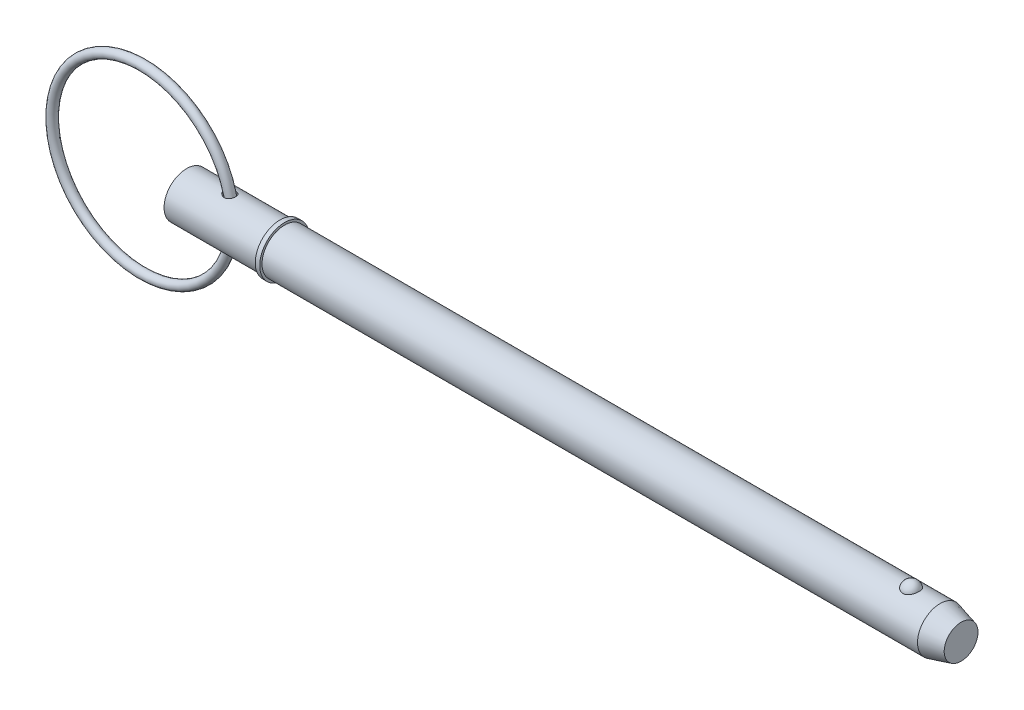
ISO-10303-21;
HEADER;
FILE_DESCRIPTION(('STEP AP214'),'2;1');
FILE_NAME('part.step','',(''),(''),'','','');
FILE_SCHEMA(('AUTOMOTIVE_DESIGN { 1 0 10303 214 1 1 1 1 }'));
ENDSEC;
DATA;
#1=APPLICATION_CONTEXT('core data for automotive mechanical design processes');
#2=APPLICATION_PROTOCOL_DEFINITION('international standard','automotive_design',2000,#1);
#3=PRODUCT_CONTEXT('',#1,'mechanical');
#4=PRODUCT('Part','Part','',(#3));
#5=PRODUCT_RELATED_PRODUCT_CATEGORY('part','',(#4));
#6=PRODUCT_DEFINITION_FORMATION('','',#4);
#7=PRODUCT_DEFINITION_CONTEXT('part definition',#1,'design');
#8=PRODUCT_DEFINITION('design','',#6,#7);
#9=PRODUCT_DEFINITION_SHAPE('','',#8);
#10=(LENGTH_UNIT() NAMED_UNIT(*) SI_UNIT(.MILLI.,.METRE.));
#11=(NAMED_UNIT(*) PLANE_ANGLE_UNIT() SI_UNIT($,.RADIAN.));
#12=(NAMED_UNIT(*) SI_UNIT($,.STERADIAN.) SOLID_ANGLE_UNIT());
#13=UNCERTAINTY_MEASURE_WITH_UNIT(LENGTH_MEASURE(1.E-05),#10,'distance_accuracy_value','');
#14=(GEOMETRIC_REPRESENTATION_CONTEXT(3) GLOBAL_UNCERTAINTY_ASSIGNED_CONTEXT((#13)) GLOBAL_UNIT_ASSIGNED_CONTEXT((#10,
#11,#12)) REPRESENTATION_CONTEXT('',''));
#15=CARTESIAN_POINT('',(0.,0.,0.));
#16=DIRECTION('',(0.,0.,1.));
#17=DIRECTION('',(1.,0.,0.));
#18=AXIS2_PLACEMENT_3D('',#15,#16,#17);
#19=CARTESIAN_POINT('',(-10.8860601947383,0.,0.));
#20=DIRECTION('',(0.,0.,1.));
#21=DIRECTION('',(1.,0.,0.));
#22=AXIS2_PLACEMENT_3D('',#19,#20,#21);
#23=TOROIDAL_SURFACE('',#22,22.225,1.111);
#24=CARTESIAN_POINT('',(12.4499398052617,0.,0.));
#25=VERTEX_POINT('',#24);
#26=VERTEX_LOOP('',#25);
#27=FACE_BOUND('',#26,.T.);
#28=ADVANCED_FACE('P0_F12',(#27),#23,.T.);
#29=CLOSED_SHELL('',(#28));
#30=MANIFOLD_SOLID_BREP('P0_B1',#29);
#31=CARTESIAN_POINT('',(0.,0.,0.));
#32=DIRECTION('',(1.,0.,0.));
#33=DIRECTION('',(0.,0.,-1.));
#34=AXIS2_PLACEMENT_3D('',#31,#32,#33);
#35=CYLINDRICAL_SURFACE('',#34,5.555);
#36=CARTESIAN_POINT('',(9.73108588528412,5.4531967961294,-1.05861687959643));
#37=CARTESIAN_POINT('',(9.79852417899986,5.4428857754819,-1.11173367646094));
#38=CARTESIAN_POINT('',(9.8705426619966,5.43287373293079,-1.15917228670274));
#39=CARTESIAN_POINT('',(10.0216706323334,5.41463354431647,-1.24159548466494));
#40=CARTESIAN_POINT('',(10.100788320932,5.40640749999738,-1.27656543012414));
#41=CARTESIAN_POINT('',(10.2640671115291,5.39277501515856,-1.33298568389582));
#42=CARTESIAN_POINT('',(10.3482338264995,5.38737178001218,-1.35442062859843));
#43=CARTESIAN_POINT('',(10.5191189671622,5.38018930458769,-1.38268153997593));
#44=CARTESIAN_POINT('',(10.6058357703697,5.37840780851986,-1.38951660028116));
#45=CARTESIAN_POINT('',(10.7759121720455,5.37883071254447,-1.38787777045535));
#46=CARTESIAN_POINT('',(10.8592768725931,5.38088957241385,-1.37996287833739));
#47=CARTESIAN_POINT('',(11.0231742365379,5.38856355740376,-1.34968531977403));
#48=CARTESIAN_POINT('',(11.1037078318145,5.39417750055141,-1.3273274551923));
#49=CARTESIAN_POINT('',(11.2542656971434,5.40784427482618,-1.27044672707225));
#50=CARTESIAN_POINT('',(11.3246325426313,5.41571997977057,-1.23678468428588));
#51=CARTESIAN_POINT('',(11.4584043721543,5.43310849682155,-1.15800564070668));
#52=CARTESIAN_POINT('',(11.5218100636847,5.44262114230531,-1.11288980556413));
#53=CARTESIAN_POINT('',(11.6387006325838,5.4619946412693,-1.01348173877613));
#54=CARTESIAN_POINT('',(11.6923567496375,5.47184490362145,-0.959388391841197));
#55=CARTESIAN_POINT('',(11.7899079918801,5.49098914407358,-0.842935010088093));
#56=CARTESIAN_POINT('',(11.8338027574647,5.5002831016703,-0.780574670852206));
#57=CARTESIAN_POINT('',(11.9111930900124,5.51740919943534,-0.648605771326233));
#58=CARTESIAN_POINT('',(11.944571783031,5.52522454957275,-0.578926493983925));
#59=CARTESIAN_POINT('',(11.9994972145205,5.5384271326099,-0.434834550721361));
#60=CARTESIAN_POINT('',(12.0210434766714,5.54381426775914,-0.360421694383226));
#61=CARTESIAN_POINT('',(12.0519313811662,5.55161917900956,-0.208311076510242));
#62=CARTESIAN_POINT('',(12.0611710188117,5.55401212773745,-0.130591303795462));
#63=CARTESIAN_POINT('',(12.0668974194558,5.55548938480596,0.025348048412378));
#64=CARTESIAN_POINT('',(12.0633840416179,5.55457365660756,0.103567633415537));
#65=CARTESIAN_POINT('',(12.0436796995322,5.54953010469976,0.258343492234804));
#66=CARTESIAN_POINT('',(12.0274798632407,5.54540003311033,0.334898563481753));
#67=CARTESIAN_POINT('',(11.9827711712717,5.53437033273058,0.484118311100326));
#68=CARTESIAN_POINT('',(11.9542620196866,5.52747063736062,0.556782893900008));
#69=CARTESIAN_POINT('',(11.8856108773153,5.51165296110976,0.696153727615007));
#70=CARTESIAN_POINT('',(11.8454690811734,5.50273501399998,0.762860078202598));
#71=CARTESIAN_POINT('',(11.7545317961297,5.48386724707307,0.888403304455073));
#72=CARTESIAN_POINT('',(11.7037367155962,5.47391746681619,0.94724048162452));
#73=CARTESIAN_POINT('',(11.5931044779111,5.45416351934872,1.05504470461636));
#74=CARTESIAN_POINT('',(11.533318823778,5.44435885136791,1.10406448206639));
#75=CARTESIAN_POINT('',(11.4061321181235,5.42595363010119,1.19123649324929));
#76=CARTESIAN_POINT('',(11.3387321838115,5.41735290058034,1.22939031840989));
#77=CARTESIAN_POINT('',(11.1991395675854,5.4024225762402,1.29341737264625));
#78=CARTESIAN_POINT('',(11.1270175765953,5.3960658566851,1.3194385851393));
#79=CARTESIAN_POINT('',(10.979323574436,5.38614405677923,1.35937634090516));
#80=CARTESIAN_POINT('',(10.9037515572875,5.38257898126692,1.37329286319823));
#81=CARTESIAN_POINT('',(10.7507722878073,5.37854282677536,1.38901730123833));
#82=CARTESIAN_POINT('',(10.6733560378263,5.37809300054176,1.39074204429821));
#83=CARTESIAN_POINT('',(10.5192388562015,5.38029043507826,1.38221411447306));
#84=CARTESIAN_POINT('',(10.4425381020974,5.38293844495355,1.37195854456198));
#85=CARTESIAN_POINT('',(10.2878936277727,5.39116673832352,1.33926960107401));
#86=CARTESIAN_POINT('',(10.2100819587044,5.3968880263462,1.31624874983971));
#87=CARTESIAN_POINT('',(10.0591420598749,5.4106466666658,1.25849276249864));
#88=CARTESIAN_POINT('',(9.98601576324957,5.41868496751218,1.22375282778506));
#89=CARTESIAN_POINT('',(9.84175565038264,5.43675805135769,1.14087469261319));
#90=CARTESIAN_POINT('',(9.77103801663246,5.44688674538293,1.09202994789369));
#91=CARTESIAN_POINT('',(9.63888287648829,5.46759592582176,0.983100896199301));
#92=CARTESIAN_POINT('',(9.57744762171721,5.47817652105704,0.923013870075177));
#93=CARTESIAN_POINT('',(9.4662044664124,5.49850106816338,0.792984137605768));
#94=CARTESIAN_POINT('',(9.4163677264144,5.5082470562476,0.723066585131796));
#95=CARTESIAN_POINT('',(9.33050546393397,5.52566389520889,0.574973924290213));
#96=CARTESIAN_POINT('',(9.29446727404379,5.53333664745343,0.496806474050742));
#97=CARTESIAN_POINT('',(9.24109888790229,5.54491199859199,0.342579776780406));
#98=CARTESIAN_POINT('',(9.22228936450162,5.54910883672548,0.26705568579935));
#99=CARTESIAN_POINT('',(9.19883437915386,5.55436306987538,0.113748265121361));
#100=CARTESIAN_POINT('',(9.19417820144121,5.55542284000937,0.0359666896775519));
#101=CARTESIAN_POINT('',(9.19905385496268,5.55432298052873,-0.111477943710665));
#102=CARTESIAN_POINT('',(9.20724428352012,5.55246769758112,-0.181191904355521));
#103=CARTESIAN_POINT('',(9.23493000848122,5.54630180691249,-0.318223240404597));
#104=CARTESIAN_POINT('',(9.25442702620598,5.54199082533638,-0.385540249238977));
#105=CARTESIAN_POINT('',(9.30387481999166,5.5313474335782,-0.516280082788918));
#106=CARTESIAN_POINT('',(9.33386163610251,5.52500806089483,-0.579688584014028));
#107=CARTESIAN_POINT('',(9.40305503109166,5.51092599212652,-0.701037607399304));
#108=CARTESIAN_POINT('',(9.44225922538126,5.50318365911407,-0.758979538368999));
#109=CARTESIAN_POINT('',(9.52133732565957,5.48833949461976,-0.859230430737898));
#110=CARTESIAN_POINT('',(9.55998996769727,5.48134889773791,-0.902529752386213));
#111=CARTESIAN_POINT('',(9.64209346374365,5.46725903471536,-0.984288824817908));
#112=CARTESIAN_POINT('',(9.68554534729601,5.46015974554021,-1.02274753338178));
#113=CARTESIAN_POINT('',(9.73108588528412,5.4531967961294,-1.05861687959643));
#114=B_SPLINE_CURVE_WITH_KNOTS('',3,(#36,#37,#38,#39,#40,#41,#42,#43,#44,#45,#46,#47,#48,#49,
#50,#51,#52,#53,#54,#55,#56,#57,#58,#59,#60,#61,#62,#63,#64,#65,#66,#67,#68,#69,#70,#71,#72,#73,
#74,#75,#76,#77,#78,#79,#80,#81,#82,#83,#84,#85,#86,#87,#88,#89,#90,#91,#92,#93,#94,#95,#96,#97,
#98,#99,#100,#101,#102,#103,#104,#105,#106,#107,#108,#109,#110,#111,#112,#113),.UNSPECIFIED.,
.T.,.F.,(4,2,2,2,2,2,2,2,2,2,2,2,2,2,2,2,2,2,2,2,2,2,2,2,2,2,2,2,2,2,2,2,2,2,2,2,2,2,4),(0.,
0.259176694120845,0.518656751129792,0.778430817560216,1.03804303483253,1.28801585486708,
1.53790560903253,1.77195750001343,2.00598558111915,2.23539047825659,2.4648038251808,
2.69668356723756,2.9285726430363,3.16237203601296,3.39617401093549,3.63013963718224,
3.86411088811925,4.09807822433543,4.33203659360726,4.56470246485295,4.79733424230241,
5.02704913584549,5.25676442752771,5.48804534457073,5.71938220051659,5.96237360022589,
6.20546461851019,6.46387943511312,6.72235683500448,6.98018450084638,7.23777490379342,
7.4702968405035,7.70264268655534,7.91229396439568,8.12197716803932,8.33238797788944,
8.54274441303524,8.71772674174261,8.89274668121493),.UNSPECIFIED.);
#115=CARTESIAN_POINT('',(9.73108588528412,5.4531967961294,-1.05861687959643));
#116=VERTEX_POINT('',#115);
#117=EDGE_CURVE('P1_E42',#116,#116,#114,.T.);
#118=ORIENTED_EDGE('',*,*,#117,.T.);
#119=EDGE_LOOP('',(#118));
#120=FACE_BOUND('',#119,.T.);
#121=CARTESIAN_POINT('',(0.,0.,0.));
#122=DIRECTION('',(1.,0.,0.));
#123=DIRECTION('',(0.,0.,-1.));
#124=AXIS2_PLACEMENT_3D('',#121,#122,#123);
#125=CIRCLE('',#124,5.555);
#126=CARTESIAN_POINT('',(0.,0.,-5.555));
#127=VERTEX_POINT('',#126);
#128=EDGE_CURVE('P1_E9',#127,#127,#125,.T.);
#129=ORIENTED_EDGE('',*,*,#128,.T.);
#130=EDGE_LOOP('',(#129));
#131=FACE_BOUND('',#130,.T.);
#132=CARTESIAN_POINT('',(23.019,0.,0.));
#133=DIRECTION('',(1.,0.,0.));
#134=DIRECTION('',(0.,0.,-1.));
#135=AXIS2_PLACEMENT_3D('',#132,#133,#134);
#136=CIRCLE('',#135,5.555);
#137=CARTESIAN_POINT('',(23.019,0.,-5.555));
#138=VERTEX_POINT('',#137);
#139=EDGE_CURVE('P1_E25',#138,#138,#136,.T.);
#140=ORIENTED_EDGE('',*,*,#139,.F.);
#141=EDGE_LOOP('',(#140));
#142=FACE_BOUND('',#141,.T.);
#143=CARTESIAN_POINT('',(9.73108588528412,-5.4531967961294,-1.05861687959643));
#144=CARTESIAN_POINT('',(9.66821110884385,-5.46281068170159,-1.00909184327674));
#145=CARTESIAN_POINT('',(9.60927221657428,-5.47269103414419,-0.954597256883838));
#146=CARTESIAN_POINT('',(9.50103698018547,-5.49196271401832,-0.836622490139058));
#147=CARTESIAN_POINT('',(9.45174193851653,-5.50135397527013,-0.773141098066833));
#148=CARTESIAN_POINT('',(9.36449982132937,-5.51864538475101,-0.638139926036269));
#149=CARTESIAN_POINT('',(9.32660692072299,-5.52653835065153,-0.566583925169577));
#150=CARTESIAN_POINT('',(9.26443740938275,-5.53978685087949,-0.417563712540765));
#151=CARTESIAN_POINT('',(9.24015003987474,-5.54514438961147,-0.34010422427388));
#152=CARTESIAN_POINT('',(9.20806696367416,-5.55228040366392,-0.188389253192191));
#153=CARTESIAN_POINT('',(9.19907227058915,-5.55431849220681,-0.114399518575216));
#154=CARTESIAN_POINT('',(9.19432225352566,-5.55539069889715,0.0340148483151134));
#155=CARTESIAN_POINT('',(9.19856204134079,-5.55442592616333,0.108439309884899));
#156=CARTESIAN_POINT('',(9.21926816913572,-5.54978420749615,0.250226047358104));
#157=CARTESIAN_POINT('',(9.2348766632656,-5.54629766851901,0.31772275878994));
#158=CARTESIAN_POINT('',(9.27656619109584,-5.53719805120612,0.449233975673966));
#159=CARTESIAN_POINT('',(9.3026486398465,-5.53158468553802,0.513248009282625));
#160=CARTESIAN_POINT('',(9.36540111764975,-5.51852259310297,0.63880901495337));
#161=CARTESIAN_POINT('',(9.40244578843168,-5.51101059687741,0.700161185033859));
#162=CARTESIAN_POINT('',(9.48531033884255,-5.49498546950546,0.816463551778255));
#163=CARTESIAN_POINT('',(9.5311337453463,-5.48647193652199,0.871411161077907));
#164=CARTESIAN_POINT('',(9.63549825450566,-5.46826315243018,0.979510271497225));
#165=CARTESIAN_POINT('',(9.69487291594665,-5.4585383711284,1.03185240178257));
#166=CARTESIAN_POINT('',(9.82107706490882,-5.43973797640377,1.12677509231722));
#167=CARTESIAN_POINT('',(9.8879103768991,-5.43066269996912,1.16935061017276));
#168=CARTESIAN_POINT('',(10.033391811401,-5.41336505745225,1.24708757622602));
#169=CARTESIAN_POINT('',(10.1125613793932,-5.40528106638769,1.28130933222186));
#170=CARTESIAN_POINT('',(10.2757060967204,-5.39196874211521,1.3362270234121));
#171=CARTESIAN_POINT('',(10.3596813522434,-5.38674047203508,1.35692265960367));
#172=CARTESIAN_POINT('',(10.5297702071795,-5.37991196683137,1.38375156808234));
#173=CARTESIAN_POINT('',(10.6158742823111,-5.37829778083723,1.38994084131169));
#174=CARTESIAN_POINT('',(10.7878226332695,-5.37901070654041,1.38718250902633));
#175=CARTESIAN_POINT('',(10.8736670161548,-5.38133587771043,1.37824235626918));
#176=CARTESIAN_POINT('',(11.0366214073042,-5.38945418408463,1.34612618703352));
#177=CARTESIAN_POINT('',(11.1139351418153,-5.39501006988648,1.32392147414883));
#178=CARTESIAN_POINT('',(11.2633246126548,-5.40877222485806,1.26652021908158));
#179=CARTESIAN_POINT('',(11.3354015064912,-5.41697790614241,1.23132655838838));
#180=CARTESIAN_POINT('',(11.4690899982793,-5.43466078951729,1.15069817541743));
#181=CARTESIAN_POINT('',(11.5310200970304,-5.4440673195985,1.10577441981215));
#182=CARTESIAN_POINT('',(11.6463540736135,-5.46335537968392,1.0061512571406));
#183=CARTESIAN_POINT('',(11.6997580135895,-5.47323690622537,0.951451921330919));
#184=CARTESIAN_POINT('',(11.7967319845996,-5.49239864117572,0.833747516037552));
#185=CARTESIAN_POINT('',(11.8402908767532,-5.50167816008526,0.770733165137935));
#186=CARTESIAN_POINT('',(11.9164538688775,-5.518621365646,0.638202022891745));
#187=CARTESIAN_POINT('',(11.9490573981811,-5.52628496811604,0.568684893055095));
#188=CARTESIAN_POINT('',(12.0028717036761,-5.53925911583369,0.424207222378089));
#189=CARTESIAN_POINT('',(12.023941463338,-5.54454040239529,0.349191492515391));
#190=CARTESIAN_POINT('',(12.053591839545,-5.55204602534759,0.196582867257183));
#191=CARTESIAN_POINT('',(12.0621722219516,-5.55427030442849,0.118989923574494));
#192=CARTESIAN_POINT('',(12.0666512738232,-5.55542602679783,-0.0368468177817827));
#193=CARTESIAN_POINT('',(12.0625074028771,-5.55434642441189,-0.11509192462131));
#194=CARTESIAN_POINT('',(12.0415418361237,-5.54898613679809,-0.269753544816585));
#195=CARTESIAN_POINT('',(12.0247199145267,-5.54470539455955,-0.346170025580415));
#196=CARTESIAN_POINT('',(11.9787920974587,-5.53340452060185,-0.495008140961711));
#197=CARTESIAN_POINT('',(11.9496857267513,-5.52638428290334,-0.56742962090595));
#198=CARTESIAN_POINT('',(11.8798787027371,-5.51036911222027,-0.706216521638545));
#199=CARTESIAN_POINT('',(11.8391779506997,-5.50137416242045,-0.772581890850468));
#200=CARTESIAN_POINT('',(11.7472553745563,-5.48242167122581,-0.897247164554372));
#201=CARTESIAN_POINT('',(11.6960515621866,-5.47246579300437,-0.955560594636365));
#202=CARTESIAN_POINT('',(11.5843994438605,-5.45270071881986,-1.06256643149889));
#203=CARTESIAN_POINT('',(11.5239521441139,-5.44289150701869,-1.11125988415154));
#204=CARTESIAN_POINT('',(11.396157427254,-5.42463941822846,-1.19717500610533));
#205=CARTESIAN_POINT('',(11.3288903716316,-5.41618309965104,-1.23451335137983));
#206=CARTESIAN_POINT('',(11.1888557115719,-5.40145691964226,-1.29743539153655));
#207=CARTESIAN_POINT('',(11.1160887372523,-5.39518680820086,-1.32302043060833));
#208=CARTESIAN_POINT('',(10.9677009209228,-5.38553131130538,-1.36179181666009));
#209=CARTESIAN_POINT('',(10.8921036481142,-5.38212602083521,-1.3750637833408));
#210=CARTESIAN_POINT('',(10.7396925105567,-5.37842027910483,-1.38948741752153));
#211=CARTESIAN_POINT('',(10.6628784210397,-5.37812040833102,-1.39063681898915));
#212=CARTESIAN_POINT('',(10.5077947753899,-5.38059635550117,-1.38102577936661));
#213=CARTESIAN_POINT('',(10.4295489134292,-5.3834629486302,-1.36991384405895));
#214=CARTESIAN_POINT('',(10.2758428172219,-5.3920092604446,-1.33587599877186));
#215=CARTESIAN_POINT('',(10.2003829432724,-5.39768934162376,-1.31294856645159));
#216=CARTESIAN_POINT('',(10.0559381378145,-5.4110281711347,-1.25682313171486));
#217=CARTESIAN_POINT('',(9.98683368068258,-5.41862962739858,-1.22391777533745));
#218=CARTESIAN_POINT('',(9.85432617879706,-5.43513913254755,-1.14838146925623));
#219=CARTESIAN_POINT('',(9.79092361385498,-5.44404729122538,-1.1057497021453));
#220=CARTESIAN_POINT('',(9.73108588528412,-5.4531967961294,-1.05861687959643));
#221=B_SPLINE_CURVE_WITH_KNOTS('',3,(#143,#144,#145,#146,#147,#148,#149,#150,#151,#152,#153,
#154,#155,#156,#157,#158,#159,#160,#161,#162,#163,#164,#165,#166,#167,#168,#169,#170,#171,#172,
#173,#174,#175,#176,#177,#178,#179,#180,#181,#182,#183,#184,#185,#186,#187,#188,#189,#190,#191,
#192,#193,#194,#195,#196,#197,#198,#199,#200,#201,#202,#203,#204,#205,#206,#207,#208,#209,#210,
#211,#212,#213,#214,#215,#216,#217,#218,#219,#220),.UNSPECIFIED.,.T.,.F.,(4,2,2,2,2,2,2,2,2,2,2,
2,2,2,2,2,2,2,2,2,2,2,2,2,2,2,2,2,2,2,2,2,2,2,2,2,2,2,4),(0.,0.241596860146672,
0.483226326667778,0.725986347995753,0.968554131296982,1.19103755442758,1.41343881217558,
1.62059806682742,1.82778531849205,2.04308674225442,2.25847484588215,2.4967195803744,
2.73508704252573,2.99374644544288,3.25241156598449,3.51007646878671,3.76761448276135,
4.00827541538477,4.24888299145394,4.47904430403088,4.70920393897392,4.93962269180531,
5.17005344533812,5.4032419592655,5.63643484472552,5.87040820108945,6.10438572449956,
6.33837230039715,6.57236086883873,6.80595147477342,7.03951667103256,7.27059385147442,
7.50164459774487,7.73107640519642,7.96055109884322,8.19677907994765,8.43303750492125,
8.66294515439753,8.89287213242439),.UNSPECIFIED.);
#222=CARTESIAN_POINT('',(9.73108588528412,-5.4531967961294,-1.05861687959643));
#223=VERTEX_POINT('',#222);
#224=EDGE_CURVE('P1_E17',#223,#223,#221,.T.);
#225=ORIENTED_EDGE('',*,*,#224,.T.);
#226=EDGE_LOOP('',(#225));
#227=FACE_BOUND('',#226,.T.);
#228=ADVANCED_FACE('P1_F13',(#120,#131,#142,#227),#35,.T.);
#229=CARTESIAN_POINT('',(0.,0.,0.));
#230=DIRECTION('',(1.,0.,0.));
#231=DIRECTION('',(0.,0.,-1.));
#232=AXIS2_PLACEMENT_3D('',#229,#230,#231);
#233=CYLINDRICAL_SURFACE('',#232,5.555);
#234=CARTESIAN_POINT('',(185.617114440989,0.,0.));
#235=DIRECTION('',(1.,0.,0.));
#236=DIRECTION('',(0.,0.,-1.));
#237=AXIS2_PLACEMENT_3D('',#234,#235,#236);
#238=CIRCLE('',#237,5.555);
#239=CARTESIAN_POINT('',(185.617114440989,0.,-5.555));
#240=VERTEX_POINT('',#239);
#241=EDGE_CURVE('P1_E99',#240,#240,#238,.T.);
#242=ORIENTED_EDGE('',*,*,#241,.F.);
#243=EDGE_LOOP('',(#242));
#244=FACE_BOUND('',#243,.T.);
#245=CARTESIAN_POINT('',(24.13,0.,0.));
#246=DIRECTION('',(1.,0.,0.));
#247=DIRECTION('',(0.,0.,-1.));
#248=AXIS2_PLACEMENT_3D('',#245,#246,#247);
#249=CIRCLE('',#248,5.555);
#250=CARTESIAN_POINT('',(24.13,0.,-5.555));
#251=VERTEX_POINT('',#250);
#252=EDGE_CURVE('P1_E96',#251,#251,#249,.T.);
#253=ORIENTED_EDGE('',*,*,#252,.T.);
#254=EDGE_LOOP('',(#253));
#255=FACE_BOUND('',#254,.T.);
#256=CARTESIAN_POINT('',(178.498626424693,5.16741224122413,2.03859650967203));
#257=CARTESIAN_POINT('',(178.392949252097,5.16740893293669,2.03859990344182));
#258=CARTESIAN_POINT('',(178.28729894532,5.17079470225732,2.03008306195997));
#259=CARTESIAN_POINT('',(178.079141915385,5.18392795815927,1.99630721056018));
#260=CARTESIAN_POINT('',(177.976634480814,5.19367399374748,1.97105201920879));
#261=CARTESIAN_POINT('',(177.777771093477,5.21839168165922,1.90463997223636));
#262=CARTESIAN_POINT('',(177.681406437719,5.23335573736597,1.86350622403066));
#263=CARTESIAN_POINT('',(177.497080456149,5.26688076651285,1.76652592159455));
#264=CARTESIAN_POINT('',(177.409120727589,5.28544242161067,1.7106765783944));
#265=CARTESIAN_POINT('',(177.241265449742,5.32479845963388,1.58399959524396));
#266=CARTESIAN_POINT('',(177.161665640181,5.34564089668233,1.51279545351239));
#267=CARTESIAN_POINT('',(177.01512901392,5.38697258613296,1.3582858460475));
#268=CARTESIAN_POINT('',(176.948194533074,5.40746177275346,1.27497815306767));
#269=CARTESIAN_POINT('',(176.82561039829,5.44694508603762,1.09440293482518));
#270=CARTESIAN_POINT('',(176.770598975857,5.46583143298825,0.996677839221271));
#271=CARTESIAN_POINT('',(176.676937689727,5.49908030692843,0.792961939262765));
#272=CARTESIAN_POINT('',(176.638289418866,5.513442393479,0.686970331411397));
#273=CARTESIAN_POINT('',(176.57768070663,5.536358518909,0.468019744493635));
#274=CARTESIAN_POINT('',(176.555972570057,5.54482455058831,0.354981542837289));
#275=CARTESIAN_POINT('',(176.530636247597,5.55473324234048,0.126595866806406));
#276=CARTESIAN_POINT('',(176.527007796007,5.55617600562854,0.0112484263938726));
#277=CARTESIAN_POINT('',(176.537881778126,5.55189984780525,-0.218011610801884));
#278=CARTESIAN_POINT('',(176.552315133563,5.54620821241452,-0.331928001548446));
#279=CARTESIAN_POINT('',(176.598903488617,5.52828920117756,-0.555544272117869));
#280=CARTESIAN_POINT('',(176.631058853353,5.5160616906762,-0.665244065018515));
#281=CARTESIAN_POINT('',(176.712488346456,5.48630779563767,-0.877469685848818));
#282=CARTESIAN_POINT('',(176.761781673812,5.4687754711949,-0.979987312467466));
#283=CARTESIAN_POINT('',(176.876478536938,5.43024700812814,-1.17486975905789));
#284=CARTESIAN_POINT('',(176.941883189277,5.4092506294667,-1.26723387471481));
#285=CARTESIAN_POINT('',(177.087571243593,5.36600927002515,-1.43940133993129));
#286=CARTESIAN_POINT('',(177.167885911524,5.34376173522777,-1.5191776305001));
#287=CARTESIAN_POINT('',(177.341452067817,5.30057971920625,-1.66360338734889));
#288=CARTESIAN_POINT('',(177.434702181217,5.27964509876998,-1.72825445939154));
#289=CARTESIAN_POINT('',(177.629393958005,5.24205250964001,-1.83909478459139));
#290=CARTESIAN_POINT('',(177.730590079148,5.22530519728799,-1.88568407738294));
#291=CARTESIAN_POINT('',(177.940155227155,5.19750919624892,-1.96100802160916));
#292=CARTESIAN_POINT('',(178.048521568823,5.18645838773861,-1.98974931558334));
#293=CARTESIAN_POINT('',(178.263498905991,5.17184410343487,-2.02742262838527));
#294=CARTESIAN_POINT('',(178.369925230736,5.16793282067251,-2.03727608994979));
#295=CARTESIAN_POINT('',(178.582992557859,5.1669899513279,-2.03966777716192));
#296=CARTESIAN_POINT('',(178.689633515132,5.16995704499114,-2.03220932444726));
#297=CARTESIAN_POINT('',(178.896773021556,5.18222383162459,-2.00071170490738));
#298=CARTESIAN_POINT('',(178.997359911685,5.19133213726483,-1.97717337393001));
#299=CARTESIAN_POINT('',(179.193014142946,5.21467637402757,-1.91475248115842));
#300=CARTESIAN_POINT('',(179.288081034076,5.22891272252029,-1.87586867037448));
#301=CARTESIAN_POINT('',(179.472371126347,5.26137066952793,-1.78282713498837));
#302=CARTESIAN_POINT('',(179.561419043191,5.27967329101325,-1.7283512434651));
#303=CARTESIAN_POINT('',(179.729288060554,5.31817411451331,-1.60597483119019));
#304=CARTESIAN_POINT('',(179.808106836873,5.33837274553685,-1.53807126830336));
#305=CARTESIAN_POINT('',(179.957515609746,5.37968287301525,-1.38688970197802));
#306=CARTESIAN_POINT('',(180.027505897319,5.40079011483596,-1.30301744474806));
#307=CARTESIAN_POINT('',(180.153012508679,5.44074401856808,-1.1245817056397));
#308=CARTESIAN_POINT('',(180.208526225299,5.4595902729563,-1.03001630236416));
#309=CARTESIAN_POINT('',(180.305550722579,5.49369849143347,-0.829439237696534));
#310=CARTESIAN_POINT('',(180.346548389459,5.50882422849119,-0.723155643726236));
#311=CARTESIAN_POINT('',(180.411125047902,5.53310911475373,-0.50477271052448));
#312=CARTESIAN_POINT('',(180.434703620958,5.54226812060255,-0.392673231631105));
#313=CARTESIAN_POINT('',(180.464013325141,5.55370358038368,-0.165459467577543));
#314=CARTESIAN_POINT('',(180.469688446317,5.55595843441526,-0.0503368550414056));
#315=CARTESIAN_POINT('',(180.462916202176,5.55329317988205,0.179288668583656));
#316=CARTESIAN_POINT('',(180.450469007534,5.54837313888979,0.293791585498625));
#317=CARTESIAN_POINT('',(180.407779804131,5.53189037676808,0.518526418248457));
#318=CARTESIAN_POINT('',(180.377598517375,5.5203503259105,0.628771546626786));
#319=CARTESIAN_POINT('',(180.300096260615,5.49182453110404,0.842318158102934));
#320=CARTESIAN_POINT('',(180.252774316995,5.47483847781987,0.945619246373));
#321=CARTESIAN_POINT('',(180.141720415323,5.43710633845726,1.14281571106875));
#322=CARTESIAN_POINT('',(180.077921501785,5.41634501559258,1.23667048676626));
#323=CARTESIAN_POINT('',(179.935357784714,5.37334572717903,1.4118524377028));
#324=CARTESIAN_POINT('',(179.85659323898,5.35110778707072,1.49317982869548));
#325=CARTESIAN_POINT('',(179.686423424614,5.30779474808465,1.64049162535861));
#326=CARTESIAN_POINT('',(179.59510026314,5.2867132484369,1.70656877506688));
#327=CARTESIAN_POINT('',(179.401739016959,5.2480485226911,1.82201372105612));
#328=CARTESIAN_POINT('',(179.299700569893,5.23046541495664,1.87138095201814));
#329=CARTESIAN_POINT('',(179.083618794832,5.20042692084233,1.95335298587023));
#330=CARTESIAN_POINT('',(178.969260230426,5.1882019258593,1.98521734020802));
#331=CARTESIAN_POINT('',(178.736130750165,5.17169804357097,2.02783294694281));
#332=CARTESIAN_POINT('',(178.617361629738,5.16741595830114,2.03859269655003));
#333=CARTESIAN_POINT('',(178.498626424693,5.16741224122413,2.03859650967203));
#334=B_SPLINE_CURVE_WITH_KNOTS('',3,(#256,#257,#258,#259,#260,#261,#262,#263,#264,#265,#266,
#267,#268,#269,#270,#271,#272,#273,#274,#275,#276,#277,#278,#279,#280,#281,#282,#283,#284,#285,
#286,#287,#288,#289,#290,#291,#292,#293,#294,#295,#296,#297,#298,#299,#300,#301,#302,#303,#304,
#305,#306,#307,#308,#309,#310,#311,#312,#313,#314,#315,#316,#317,#318,#319,#320,#321,#322,#323,
#324,#325,#326,#327,#328,#329,#330,#331,#332,#333),.UNSPECIFIED.,.T.,.F.,(4,2,2,2,2,2,2,2,2,2,2,
2,2,2,2,2,2,2,2,2,2,2,2,2,2,2,2,2,2,2,2,2,2,2,2,2,2,2,4),(0.,0.316595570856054,
0.633118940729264,0.949183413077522,1.26530783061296,1.59030762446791,1.91536729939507,
2.25495824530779,2.59458224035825,2.93917283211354,3.2837583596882,3.62703002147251,
3.970308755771,4.31397329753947,4.65766166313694,5.00207904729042,5.34645984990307,
5.68270547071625,6.01882587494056,6.33808403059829,6.65728093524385,6.96696376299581,
7.27667180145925,7.59321535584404,7.90983070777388,8.2421038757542,8.5744368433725,
8.91755896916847,9.26068933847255,9.60489211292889,9.94909164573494,10.2921194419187,
10.6351667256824,10.9796305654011,11.324088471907,11.6663928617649,12.0087088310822,
12.3645679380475,12.7202837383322),.UNSPECIFIED.);
#335=CARTESIAN_POINT('',(178.498626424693,5.16741224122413,2.03859650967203));
#336=VERTEX_POINT('',#335);
#337=EDGE_CURVE('P1_E34',#336,#336,#334,.T.);
#338=ORIENTED_EDGE('',*,*,#337,.T.);
#339=EDGE_LOOP('',(#338));
#340=FACE_BOUND('',#339,.T.);
#341=ADVANCED_FACE('P1_F46',(#244,#255,#340),#233,.T.);
#342=CARTESIAN_POINT('',(0.,0.,0.));
#343=DIRECTION('',(-1.,0.,0.));
#344=DIRECTION('',(0.,0.,1.));
#345=AXIS2_PLACEMENT_3D('',#342,#343,#344);
#346=PLANE('',#345);
#347=ORIENTED_EDGE('',*,*,#128,.F.);
#348=EDGE_LOOP('',(#347));
#349=FACE_BOUND('',#348,.T.);
#350=ADVANCED_FACE('P1_F15',(#349),#346,.T.);
#351=CARTESIAN_POINT('',(23.019,5.555,0.));
#352=DIRECTION('',(-1.,0.,0.));
#353=DIRECTION('',(0.,0.,1.));
#354=AXIS2_PLACEMENT_3D('',#351,#352,#353);
#355=PLANE('',#354);
#356=ORIENTED_EDGE('',*,*,#139,.T.);
#357=EDGE_LOOP('',(#356));
#358=FACE_BOUND('',#357,.T.);
#359=CARTESIAN_POINT('',(23.019,0.,0.));
#360=DIRECTION('',(1.,0.,0.));
#361=DIRECTION('',(0.,0.,-1.));
#362=AXIS2_PLACEMENT_3D('',#359,#360,#361);
#363=CIRCLE('',#362,6.1105);
#364=CARTESIAN_POINT('',(23.019,0.,-6.1105));
#365=VERTEX_POINT('',#364);
#366=EDGE_CURVE('P1_E30',#365,#365,#363,.T.);
#367=ORIENTED_EDGE('',*,*,#366,.F.);
#368=EDGE_LOOP('',(#367));
#369=FACE_BOUND('',#368,.T.);
#370=ADVANCED_FACE('P1_F81',(#358,#369),#355,.T.);
#371=CARTESIAN_POINT('',(0.,0.,0.));
#372=DIRECTION('',(1.,0.,0.));
#373=DIRECTION('',(0.,0.,-1.));
#374=AXIS2_PLACEMENT_3D('',#371,#372,#373);
#375=CYLINDRICAL_SURFACE('',#374,6.1105);
#376=ORIENTED_EDGE('',*,*,#366,.T.);
#377=EDGE_LOOP('',(#376));
#378=FACE_BOUND('',#377,.T.);
#379=CARTESIAN_POINT('',(24.13,0.,0.));
#380=DIRECTION('',(1.,0.,0.));
#381=DIRECTION('',(0.,0.,-1.));
#382=AXIS2_PLACEMENT_3D('',#379,#380,#381);
#383=CIRCLE('',#382,6.1105);
#384=CARTESIAN_POINT('',(24.13,0.,-6.1105));
#385=VERTEX_POINT('',#384);
#386=EDGE_CURVE('P1_E95',#385,#385,#383,.T.);
#387=ORIENTED_EDGE('',*,*,#386,.F.);
#388=EDGE_LOOP('',(#387));
#389=FACE_BOUND('',#388,.T.);
#390=ADVANCED_FACE('P1_F68',(#378,#389),#375,.T.);
#391=CARTESIAN_POINT('',(24.13,6.1105,0.));
#392=DIRECTION('',(1.,0.,0.));
#393=DIRECTION('',(0.,0.,-1.));
#394=AXIS2_PLACEMENT_3D('',#391,#392,#393);
#395=PLANE('',#394);
#396=ORIENTED_EDGE('',*,*,#386,.T.);
#397=EDGE_LOOP('',(#396));
#398=FACE_BOUND('',#397,.T.);
#399=ORIENTED_EDGE('',*,*,#252,.F.);
#400=EDGE_LOOP('',(#399));
#401=FACE_BOUND('',#400,.T.);
#402=ADVANCED_FACE('P1_F62',(#398,#401),#395,.T.);
#403=CARTESIAN_POINT('',(190.8,0.,0.));
#404=DIRECTION('',(-1.,0.,0.));
#405=DIRECTION('',(0.,0.,1.));
#406=AXIS2_PLACEMENT_3D('',#403,#404,#405);
#407=CONICAL_SURFACE('',#406,4.16625000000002,0.261799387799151);
#408=ORIENTED_EDGE('',*,*,#241,.T.);
#409=EDGE_LOOP('',(#408));
#410=FACE_BOUND('',#409,.T.);
#411=CARTESIAN_POINT('',(190.8,0.,0.));
#412=DIRECTION('',(1.,0.,0.));
#413=DIRECTION('',(0.,0.,-1.));
#414=AXIS2_PLACEMENT_3D('',#411,#412,#413);
#415=CIRCLE('',#414,4.16625000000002);
#416=CARTESIAN_POINT('',(190.8,0.,-4.16625000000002));
#417=VERTEX_POINT('',#416);
#418=EDGE_CURVE('P1_E41',#417,#417,#415,.T.);
#419=ORIENTED_EDGE('',*,*,#418,.F.);
#420=EDGE_LOOP('',(#419));
#421=FACE_BOUND('',#420,.T.);
#422=ADVANCED_FACE('P1_F59',(#410,#421),#407,.T.);
#423=CARTESIAN_POINT('',(190.8,4.16625000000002,0.));
#424=DIRECTION('',(1.,0.,0.));
#425=DIRECTION('',(0.,0.,-1.));
#426=AXIS2_PLACEMENT_3D('',#423,#424,#425);
#427=PLANE('',#426);
#428=ORIENTED_EDGE('',*,*,#418,.T.);
#429=EDGE_LOOP('',(#428));
#430=FACE_BOUND('',#429,.T.);
#431=ADVANCED_FACE('P1_F55',(#430),#427,.T.);
#432=CARTESIAN_POINT('',(178.498626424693,4.99949999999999,0.));
#433=DIRECTION('',(-1.,0.,0.));
#434=DIRECTION('',(0.,1.,0.));
#435=AXIS2_PLACEMENT_3D('',#432,#433,#434);
#436=SPHERICAL_SURFACE('',#435,2.04549999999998);
#437=ORIENTED_EDGE('',*,*,#337,.F.);
#438=EDGE_LOOP('',(#437));
#439=FACE_BOUND('',#438,.T.);
#440=ADVANCED_FACE('P1_F50',(#439),#436,.T.);
#441=CARTESIAN_POINT('',(-10.8860601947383,0.,0.));
#442=DIRECTION('',(0.,0.,1.));
#443=DIRECTION('',(1.,0.,0.));
#444=AXIS2_PLACEMENT_3D('',#441,#442,#443);
#445=TOROIDAL_SURFACE('',#444,22.225,1.38875);
#446=ORIENTED_EDGE('',*,*,#224,.F.);
#447=EDGE_LOOP('',(#446));
#448=FACE_BOUND('',#447,.T.);
#449=ORIENTED_EDGE('',*,*,#117,.F.);
#450=EDGE_LOOP('',(#449));
#451=FACE_BOUND('',#450,.T.);
#452=ADVANCED_FACE('P1_F54',(#448,#451),#445,.F.);
#453=CLOSED_SHELL('',(#228,#341,#350,#370,#390,#402,#422,#431,#440,#452));
#454=MANIFOLD_SOLID_BREP('P1_B1',#453);
#455=ADVANCED_BREP_SHAPE_REPRESENTATION('',(#18,#30,#454),#14);
#456=SHAPE_DEFINITION_REPRESENTATION(#9,#455);
ENDSEC;
END-ISO-10303-21;
